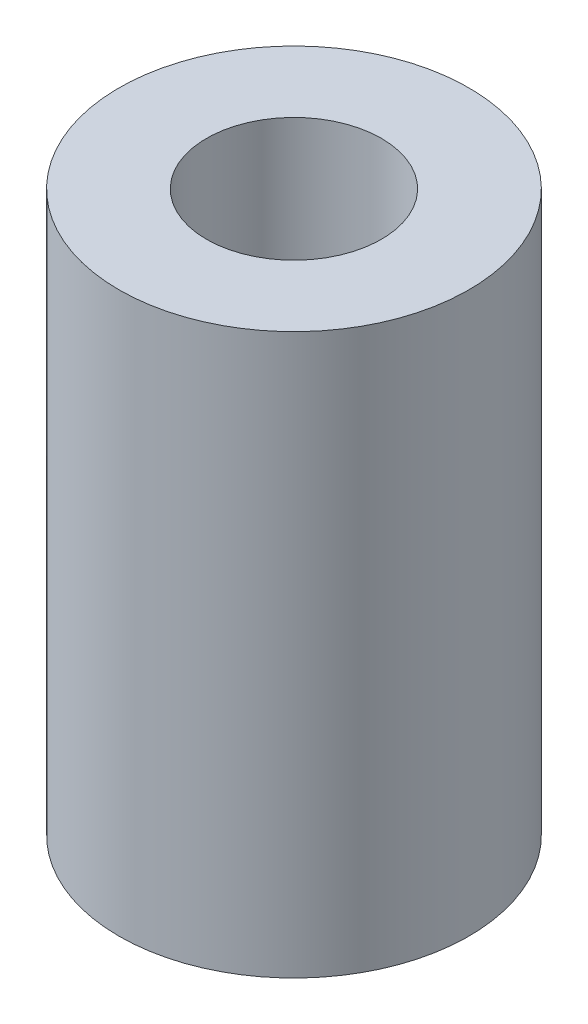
ISO-10303-21;
HEADER;
FILE_DESCRIPTION(('STEP AP214'),'2;1');
FILE_NAME('part.step','',(''),(''),'','','');
FILE_SCHEMA(('AUTOMOTIVE_DESIGN { 1 0 10303 214 1 1 1 1 }'));
ENDSEC;
DATA;
#1=APPLICATION_CONTEXT('core data for automotive mechanical design processes');
#2=APPLICATION_PROTOCOL_DEFINITION('international standard','automotive_design',2000,#1);
#3=PRODUCT_CONTEXT('',#1,'mechanical');
#4=PRODUCT('Part','Part','',(#3));
#5=PRODUCT_RELATED_PRODUCT_CATEGORY('part','',(#4));
#6=PRODUCT_DEFINITION_FORMATION('','',#4);
#7=PRODUCT_DEFINITION_CONTEXT('part definition',#1,'design');
#8=PRODUCT_DEFINITION('design','',#6,#7);
#9=PRODUCT_DEFINITION_SHAPE('','',#8);
#10=(LENGTH_UNIT() NAMED_UNIT(*) SI_UNIT(.MILLI.,.METRE.));
#11=(NAMED_UNIT(*) PLANE_ANGLE_UNIT() SI_UNIT($,.RADIAN.));
#12=(NAMED_UNIT(*) SI_UNIT($,.STERADIAN.) SOLID_ANGLE_UNIT());
#13=UNCERTAINTY_MEASURE_WITH_UNIT(LENGTH_MEASURE(1.E-05),#10,'distance_accuracy_value','');
#14=(GEOMETRIC_REPRESENTATION_CONTEXT(3) GLOBAL_UNCERTAINTY_ASSIGNED_CONTEXT((#13)) GLOBAL_UNIT_ASSIGNED_CONTEXT((#10,
#11,#12)) REPRESENTATION_CONTEXT('',''));
#15=CARTESIAN_POINT('',(0.,0.,0.));
#16=DIRECTION('',(0.,0.,1.));
#17=DIRECTION('',(1.,0.,0.));
#18=AXIS2_PLACEMENT_3D('',#15,#16,#17);
#19=CARTESIAN_POINT('',(1027.16871949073,1032.36700558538,1037.10591872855));
#20=DIRECTION('',(0.,-1.,0.));
#21=DIRECTION('',(0.,0.,-1.));
#22=AXIS2_PLACEMENT_3D('',#19,#20,#21);
#23=CYLINDRICAL_SURFACE('',#22,2.49999999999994);
#24=CARTESIAN_POINT('',(1027.16871949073,1022.36700558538,1037.10591872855));
#25=DIRECTION('',(0.,1.,0.));
#26=DIRECTION('',(0.,0.,1.));
#27=AXIS2_PLACEMENT_3D('',#24,#25,#26);
#28=CIRCLE('',#27,2.49999999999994);
#29=CARTESIAN_POINT('',(1027.16871949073,1022.36700558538,1039.60591872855));
#30=VERTEX_POINT('',#29);
#31=EDGE_CURVE('E23',#30,#30,#28,.T.);
#32=ORIENTED_EDGE('',*,*,#31,.T.);
#33=EDGE_LOOP('',(#32));
#34=FACE_BOUND('',#33,.T.);
#35=CARTESIAN_POINT('',(1027.16871949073,1030.36700558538,1037.10591872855));
#36=DIRECTION('',(0.,1.,0.));
#37=DIRECTION('',(0.,0.,1.));
#38=AXIS2_PLACEMENT_3D('',#35,#36,#37);
#39=CIRCLE('',#38,2.49999999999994);
#40=CARTESIAN_POINT('',(1027.16871949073,1030.36700558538,1039.60591872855));
#41=VERTEX_POINT('',#40);
#42=EDGE_CURVE('E39',#41,#41,#39,.T.);
#43=ORIENTED_EDGE('',*,*,#42,.F.);
#44=EDGE_LOOP('',(#43));
#45=FACE_BOUND('',#44,.T.);
#46=ADVANCED_FACE('F15',(#34,#45),#23,.T.);
#47=CARTESIAN_POINT('',(1027.16871949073,1032.36700558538,1037.10591872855));
#48=DIRECTION('',(0.,-1.,0.));
#49=DIRECTION('',(0.,0.,-1.));
#50=AXIS2_PLACEMENT_3D('',#47,#48,#49);
#51=CYLINDRICAL_SURFACE('',#50,1.24999999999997);
#52=CARTESIAN_POINT('',(1027.16871949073,1022.36700558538,1037.10591872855));
#53=DIRECTION('',(0.,1.,0.));
#54=DIRECTION('',(0.,0.,1.));
#55=AXIS2_PLACEMENT_3D('',#52,#53,#54);
#56=CIRCLE('',#55,1.24999999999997);
#57=CARTESIAN_POINT('',(1027.16871949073,1022.36700558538,1038.35591872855));
#58=VERTEX_POINT('',#57);
#59=EDGE_CURVE('E10',#58,#58,#56,.T.);
#60=ORIENTED_EDGE('',*,*,#59,.F.);
#61=EDGE_LOOP('',(#60));
#62=FACE_BOUND('',#61,.T.);
#63=CARTESIAN_POINT('',(1027.16871949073,1030.36700558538,1037.10591872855));
#64=DIRECTION('',(0.,-1.,0.));
#65=DIRECTION('',(0.,0.,1.));
#66=AXIS2_PLACEMENT_3D('',#63,#64,#65);
#67=CIRCLE('',#66,1.24999999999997);
#68=CARTESIAN_POINT('',(1027.16871949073,1030.36700558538,1038.35591872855));
#69=VERTEX_POINT('',#68);
#70=EDGE_CURVE('E32',#69,#69,#67,.T.);
#71=ORIENTED_EDGE('',*,*,#70,.F.);
#72=EDGE_LOOP('',(#71));
#73=FACE_BOUND('',#72,.T.);
#74=ADVANCED_FACE('F17',(#62,#73),#51,.F.);
#75=CARTESIAN_POINT('',(1027.16871949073,1022.36700558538,1037.10591872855));
#76=DIRECTION('',(0.,1.,0.));
#77=DIRECTION('',(1.,0.,0.));
#78=AXIS2_PLACEMENT_3D('',#75,#76,#77);
#79=PLANE('',#78);
#80=ORIENTED_EDGE('',*,*,#59,.T.);
#81=EDGE_LOOP('',(#80));
#82=FACE_BOUND('',#81,.T.);
#83=ORIENTED_EDGE('',*,*,#31,.F.);
#84=EDGE_LOOP('',(#83));
#85=FACE_BOUND('',#84,.T.);
#86=ADVANCED_FACE('F56',(#82,#85),#79,.F.);
#87=CARTESIAN_POINT('',(1027.16871949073,1030.36700558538,1037.10591872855));
#88=DIRECTION('',(0.,1.,0.));
#89=DIRECTION('',(1.,0.,0.));
#90=AXIS2_PLACEMENT_3D('',#87,#88,#89);
#91=PLANE('',#90);
#92=ORIENTED_EDGE('',*,*,#70,.T.);
#93=EDGE_LOOP('',(#92));
#94=FACE_BOUND('',#93,.T.);
#95=ORIENTED_EDGE('',*,*,#42,.T.);
#96=EDGE_LOOP('',(#95));
#97=FACE_BOUND('',#96,.T.);
#98=ADVANCED_FACE('F48',(#94,#97),#91,.T.);
#99=CLOSED_SHELL('',(#46,#74,#86,#98));
#100=MANIFOLD_SOLID_BREP('B1',#99);
#101=ADVANCED_BREP_SHAPE_REPRESENTATION('',(#18,#100),#14);
#102=SHAPE_DEFINITION_REPRESENTATION(#9,#101);
ENDSEC;
END-ISO-10303-21;
